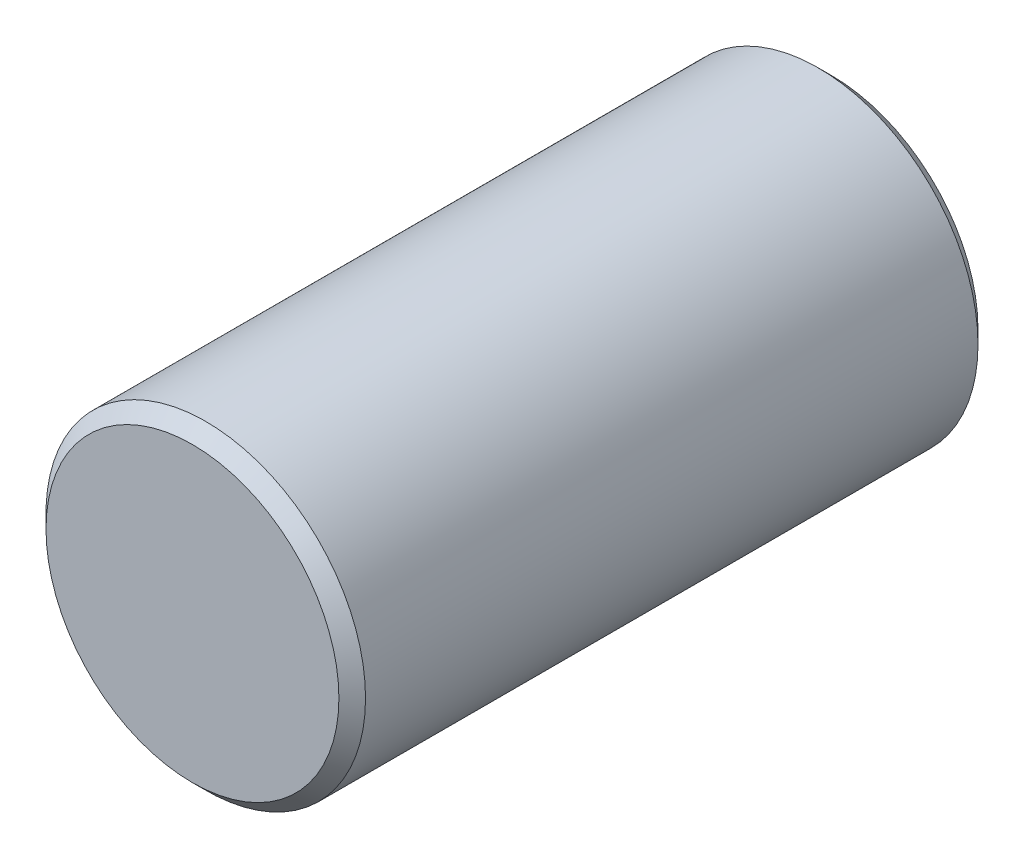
ISO-10303-21;
HEADER;
FILE_DESCRIPTION(('STEP AP214'),'2;1');
FILE_NAME('part.step','',(''),(''),'','','');
FILE_SCHEMA(('AUTOMOTIVE_DESIGN { 1 0 10303 214 1 1 1 1 }'));
ENDSEC;
DATA;
#1=APPLICATION_CONTEXT('core data for automotive mechanical design processes');
#2=APPLICATION_PROTOCOL_DEFINITION('international standard','automotive_design',2000,#1);
#3=PRODUCT_CONTEXT('',#1,'mechanical');
#4=PRODUCT('Part','Part','',(#3));
#5=PRODUCT_RELATED_PRODUCT_CATEGORY('part','',(#4));
#6=PRODUCT_DEFINITION_FORMATION('','',#4);
#7=PRODUCT_DEFINITION_CONTEXT('part definition',#1,'design');
#8=PRODUCT_DEFINITION('design','',#6,#7);
#9=PRODUCT_DEFINITION_SHAPE('','',#8);
#10=(LENGTH_UNIT() NAMED_UNIT(*) SI_UNIT(.MILLI.,.METRE.));
#11=(NAMED_UNIT(*) PLANE_ANGLE_UNIT() SI_UNIT($,.RADIAN.));
#12=(NAMED_UNIT(*) SI_UNIT($,.STERADIAN.) SOLID_ANGLE_UNIT());
#13=UNCERTAINTY_MEASURE_WITH_UNIT(LENGTH_MEASURE(1.E-05),#10,'distance_accuracy_value','');
#14=(GEOMETRIC_REPRESENTATION_CONTEXT(3) GLOBAL_UNCERTAINTY_ASSIGNED_CONTEXT((#13)) GLOBAL_UNIT_ASSIGNED_CONTEXT((#10,
#11,#12)) REPRESENTATION_CONTEXT('',''));
#15=CARTESIAN_POINT('',(0.,0.,0.));
#16=DIRECTION('',(0.,0.,1.));
#17=DIRECTION('',(1.,0.,0.));
#18=AXIS2_PLACEMENT_3D('',#15,#16,#17);
#19=CARTESIAN_POINT('',(0.,0.,-10.6746912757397));
#20=DIRECTION('',(0.,0.,1.));
#21=DIRECTION('',(1.,0.,0.));
#22=AXIS2_PLACEMENT_3D('',#19,#20,#21);
#23=CYLINDRICAL_SURFACE('',#22,3.);
#24=CARTESIAN_POINT('',(0.,0.,-0.250013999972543));
#25=DIRECTION('',(0.,0.,1.));
#26=DIRECTION('',(1.,0.,0.));
#27=AXIS2_PLACEMENT_3D('',#24,#25,#26);
#28=CIRCLE('',#27,3.);
#29=CARTESIAN_POINT('',(3.,0.,-0.250013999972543));
#30=VERTEX_POINT('',#29);
#31=EDGE_CURVE('E10',#30,#30,#28,.T.);
#32=ORIENTED_EDGE('',*,*,#31,.F.);
#33=EDGE_LOOP('',(#32));
#34=FACE_BOUND('',#33,.T.);
#35=CARTESIAN_POINT('',(0.,0.,-11.7499860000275));
#36=DIRECTION('',(0.,0.,1.));
#37=DIRECTION('',(1.,0.,0.));
#38=AXIS2_PLACEMENT_3D('',#35,#36,#37);
#39=CIRCLE('',#38,3.);
#40=CARTESIAN_POINT('',(3.,0.,-11.7499860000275));
#41=VERTEX_POINT('',#40);
#42=EDGE_CURVE('E42',#41,#41,#39,.T.);
#43=ORIENTED_EDGE('',*,*,#42,.T.);
#44=EDGE_LOOP('',(#43));
#45=FACE_BOUND('',#44,.T.);
#46=ADVANCED_FACE('F28',(#34,#45),#23,.T.);
#47=CARTESIAN_POINT('',(0.,0.,-0.250013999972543));
#48=DIRECTION('',(0.,0.,-1.));
#49=DIRECTION('',(-1.,0.,0.));
#50=AXIS2_PLACEMENT_3D('',#47,#48,#49);
#51=CONICAL_SURFACE('',#50,3.,0.78539816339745);
#52=CARTESIAN_POINT('',(0.,0.,0.));
#53=DIRECTION('',(0.,0.,1.));
#54=DIRECTION('',(1.,0.,0.));
#55=AXIS2_PLACEMENT_3D('',#52,#53,#54);
#56=CIRCLE('',#55,2.74998600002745);
#57=CARTESIAN_POINT('',(2.74998600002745,0.,0.));
#58=VERTEX_POINT('',#57);
#59=EDGE_CURVE('E34',#58,#58,#56,.T.);
#60=ORIENTED_EDGE('',*,*,#59,.F.);
#61=EDGE_LOOP('',(#60));
#62=FACE_BOUND('',#61,.T.);
#63=ORIENTED_EDGE('',*,*,#31,.T.);
#64=EDGE_LOOP('',(#63));
#65=FACE_BOUND('',#64,.T.);
#66=ADVANCED_FACE('F62',(#62,#65),#51,.T.);
#67=CARTESIAN_POINT('',(0.,2.74998600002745,0.));
#68=DIRECTION('',(0.,0.,-1.));
#69=DIRECTION('',(-1.,0.,0.));
#70=AXIS2_PLACEMENT_3D('',#67,#68,#69);
#71=PLANE('',#70);
#72=ORIENTED_EDGE('',*,*,#59,.T.);
#73=EDGE_LOOP('',(#72));
#74=FACE_BOUND('',#73,.T.);
#75=ADVANCED_FACE('F57',(#74),#71,.F.);
#76=CARTESIAN_POINT('',(0.,0.,-12.));
#77=DIRECTION('',(0.,0.,1.));
#78=DIRECTION('',(1.,0.,0.));
#79=AXIS2_PLACEMENT_3D('',#76,#77,#78);
#80=PLANE('',#79);
#81=CARTESIAN_POINT('',(0.,0.,-12.));
#82=DIRECTION('',(0.,0.,1.));
#83=DIRECTION('',(1.,0.,0.));
#84=AXIS2_PLACEMENT_3D('',#81,#82,#83);
#85=CIRCLE('',#84,2.74998600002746);
#86=CARTESIAN_POINT('',(2.74998600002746,0.,-12.));
#87=VERTEX_POINT('',#86);
#88=EDGE_CURVE('E38',#87,#87,#85,.T.);
#89=ORIENTED_EDGE('',*,*,#88,.F.);
#90=EDGE_LOOP('',(#89));
#91=FACE_BOUND('',#90,.T.);
#92=ADVANCED_FACE('F52',(#91),#80,.F.);
#93=CARTESIAN_POINT('',(0.,0.,-12.));
#94=DIRECTION('',(0.,0.,1.));
#95=DIRECTION('',(1.,0.,0.));
#96=AXIS2_PLACEMENT_3D('',#93,#94,#95);
#97=CONICAL_SURFACE('',#96,2.74998600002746,0.785398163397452);
#98=ORIENTED_EDGE('',*,*,#42,.F.);
#99=EDGE_LOOP('',(#98));
#100=FACE_BOUND('',#99,.T.);
#101=ORIENTED_EDGE('',*,*,#88,.T.);
#102=EDGE_LOOP('',(#101));
#103=FACE_BOUND('',#102,.T.);
#104=ADVANCED_FACE('F49',(#100,#103),#97,.T.);
#105=CLOSED_SHELL('',(#46,#66,#75,#92,#104));
#106=MANIFOLD_SOLID_BREP('B2',#105);
#107=ADVANCED_BREP_SHAPE_REPRESENTATION('',(#18,#106),#14);
#108=SHAPE_DEFINITION_REPRESENTATION(#9,#107);
ENDSEC;
END-ISO-10303-21;
